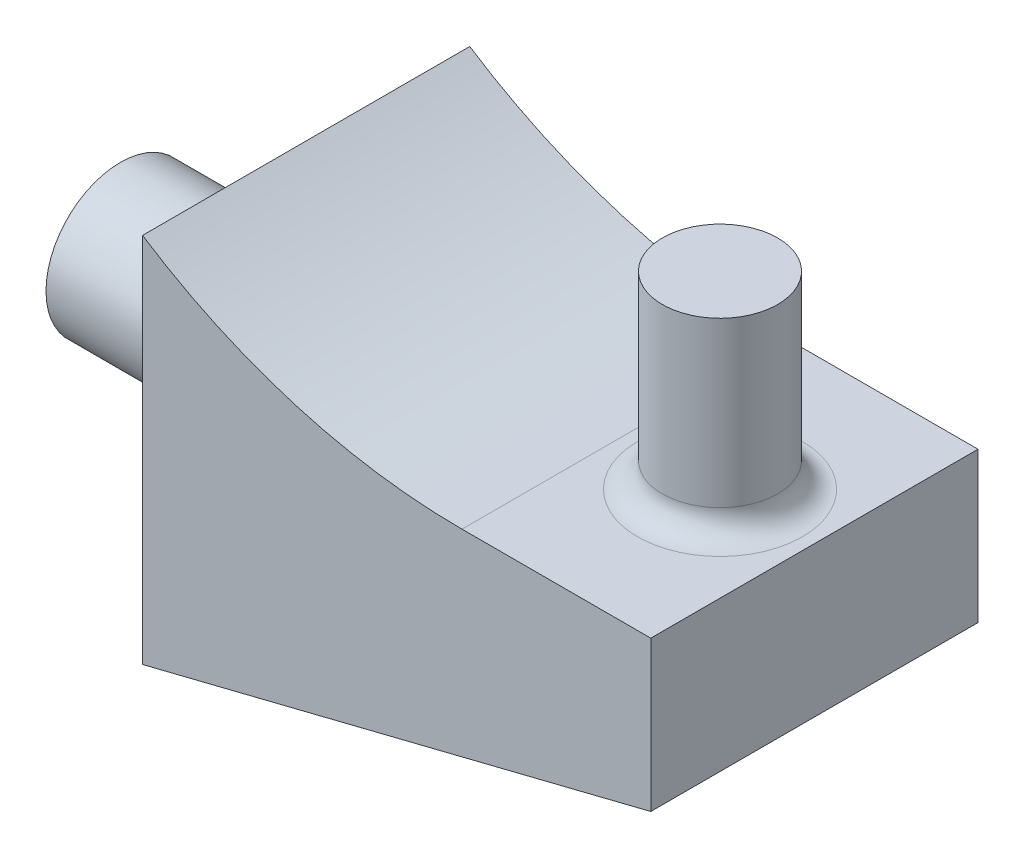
ISO-10303-21;
HEADER;
FILE_DESCRIPTION(('STEP AP214'),'2;1');
FILE_NAME('part.step','',(''),(''),'','','');
FILE_SCHEMA(('AUTOMOTIVE_DESIGN { 1 0 10303 214 1 1 1 1 }'));
ENDSEC;
DATA;
#1=APPLICATION_CONTEXT('core data for automotive mechanical design processes');
#2=APPLICATION_PROTOCOL_DEFINITION('international standard','automotive_design',2000,#1);
#3=PRODUCT_CONTEXT('',#1,'mechanical');
#4=PRODUCT('Part','Part','',(#3));
#5=PRODUCT_RELATED_PRODUCT_CATEGORY('part','',(#4));
#6=PRODUCT_DEFINITION_FORMATION('','',#4);
#7=PRODUCT_DEFINITION_CONTEXT('part definition',#1,'design');
#8=PRODUCT_DEFINITION('design','',#6,#7);
#9=PRODUCT_DEFINITION_SHAPE('','',#8);
#10=(LENGTH_UNIT() NAMED_UNIT(*) SI_UNIT(.MILLI.,.METRE.));
#11=(NAMED_UNIT(*) PLANE_ANGLE_UNIT() SI_UNIT($,.RADIAN.));
#12=(NAMED_UNIT(*) SI_UNIT($,.STERADIAN.) SOLID_ANGLE_UNIT());
#13=UNCERTAINTY_MEASURE_WITH_UNIT(LENGTH_MEASURE(1.E-05),#10,'distance_accuracy_value','');
#14=(GEOMETRIC_REPRESENTATION_CONTEXT(3) GLOBAL_UNCERTAINTY_ASSIGNED_CONTEXT((#13)) GLOBAL_UNIT_ASSIGNED_CONTEXT((#10,
#11,#12)) REPRESENTATION_CONTEXT('',''));
#15=CARTESIAN_POINT('',(0.,0.,0.));
#16=DIRECTION('',(0.,0.,1.));
#17=DIRECTION('',(1.,0.,0.));
#18=AXIS2_PLACEMENT_3D('',#15,#16,#17);
#19=CARTESIAN_POINT('',(279.196722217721,314.68729340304,26.416));
#20=DIRECTION('',(0.,0.,-1.));
#21=DIRECTION('',(-1.,0.,0.));
#22=AXIS2_PLACEMENT_3D('',#19,#20,#21);
#23=CYLINDRICAL_SURFACE('',#22,47.3438129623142);
#24=CARTESIAN_POINT('',(279.196722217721,314.68729340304,0.));
#25=DIRECTION('',(0.,0.,-1.));
#26=DIRECTION('',(-1.,0.,0.));
#27=AXIS2_PLACEMENT_3D('',#24,#25,#26);
#28=CIRCLE('',#27,47.3438129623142);
#29=CARTESIAN_POINT('',(279.196722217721,267.343480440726,0.));
#30=VERTEX_POINT('',#29);
#31=CARTESIAN_POINT('',(253.40533417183,274.985392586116,0.));
#32=VERTEX_POINT('',#31);
#33=EDGE_CURVE('E122',#30,#32,#28,.T.);
#34=ORIENTED_EDGE('',*,*,#33,.T.);
#35=DIRECTION('',(0.,0.,-1.));
#36=VECTOR('',#35,1.);
#37=CARTESIAN_POINT('',(253.40533417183,274.985392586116,26.416));
#38=LINE('',#37,#36);
#39=CARTESIAN_POINT('',(253.40533417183,274.985392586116,26.416));
#40=VERTEX_POINT('',#39);
#41=EDGE_CURVE('E135',#40,#32,#38,.T.);
#42=ORIENTED_EDGE('',*,*,#41,.F.);
#43=CARTESIAN_POINT('',(279.196722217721,314.68729340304,26.416));
#44=DIRECTION('',(0.,0.,-1.));
#45=DIRECTION('',(-1.,0.,0.));
#46=AXIS2_PLACEMENT_3D('',#43,#44,#45);
#47=CIRCLE('',#46,47.3438129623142);
#48=CARTESIAN_POINT('',(279.196722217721,267.343480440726,26.416));
#49=VERTEX_POINT('',#48);
#50=EDGE_CURVE('E131',#49,#40,#47,.T.);
#51=ORIENTED_EDGE('',*,*,#50,.F.);
#52=DIRECTION('',(0.,0.,-1.));
#53=VECTOR('',#52,1.);
#54=CARTESIAN_POINT('',(279.196722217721,267.343480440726,26.416));
#55=LINE('',#54,#53);
#56=EDGE_CURVE('E118',#49,#30,#55,.T.);
#57=ORIENTED_EDGE('',*,*,#56,.T.);
#58=EDGE_LOOP('',(#34,#42,#51,#57));
#59=FACE_BOUND('',#58,.T.);
#60=ADVANCED_FACE('F45',(#59),#23,.F.);
#61=CARTESIAN_POINT('',(253.40533417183,274.985392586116,26.416));
#62=DIRECTION('',(1.,0.,0.));
#63=DIRECTION('',(0.,0.,-1.));
#64=AXIS2_PLACEMENT_3D('',#61,#62,#63);
#65=PLANE('',#64);
#66=CARTESIAN_POINT('',(253.40533417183,259.985392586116,13.208));
#67=DIRECTION('',(1.,0.,0.));
#68=DIRECTION('',(0.,0.,-1.));
#69=AXIS2_PLACEMENT_3D('',#66,#67,#68);
#70=CIRCLE('',#69,8.);
#71=CARTESIAN_POINT('',(253.40533417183,259.985392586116,5.208));
#72=VERTEX_POINT('',#71);
#73=EDGE_CURVE('E140',#72,#72,#70,.T.);
#74=ORIENTED_EDGE('',*,*,#73,.T.);
#75=EDGE_LOOP('',(#74));
#76=FACE_BOUND('',#75,.T.);
#77=DIRECTION('',(0.,-1.,0.));
#78=VECTOR('',#77,1.);
#79=CARTESIAN_POINT('',(253.40533417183,274.985392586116,0.));
#80=LINE('',#79,#78);
#81=CARTESIAN_POINT('',(253.40533417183,244.985392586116,0.));
#82=VERTEX_POINT('',#81);
#83=EDGE_CURVE('E125',#32,#82,#80,.T.);
#84=ORIENTED_EDGE('',*,*,#83,.T.);
#85=DIRECTION('',(0.,0.,-1.));
#86=VECTOR('',#85,1.);
#87=CARTESIAN_POINT('',(253.40533417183,244.985392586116,26.416));
#88=LINE('',#87,#86);
#89=CARTESIAN_POINT('',(253.40533417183,244.985392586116,26.416));
#90=VERTEX_POINT('',#89);
#91=EDGE_CURVE('E113',#90,#82,#88,.T.);
#92=ORIENTED_EDGE('',*,*,#91,.F.);
#93=DIRECTION('',(0.,-1.,0.));
#94=VECTOR('',#93,1.);
#95=CARTESIAN_POINT('',(253.40533417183,274.985392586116,26.416));
#96=LINE('',#95,#94);
#97=EDGE_CURVE('E97',#40,#90,#96,.T.);
#98=ORIENTED_EDGE('',*,*,#97,.F.);
#99=ORIENTED_EDGE('',*,*,#41,.T.);
#100=EDGE_LOOP('',(#84,#92,#98,#99));
#101=FACE_BOUND('',#100,.T.);
#102=ADVANCED_FACE('F159',(#76,#101),#65,.F.);
#103=CARTESIAN_POINT('',(253.40533417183,244.985392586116,26.416));
#104=DIRECTION('',(-0.242055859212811,0.970262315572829,0.));
#105=DIRECTION('',(-0.970262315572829,-0.242055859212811,0.));
#106=AXIS2_PLACEMENT_3D('',#103,#104,#105);
#107=PLANE('',#106);
#108=DIRECTION('',(0.970262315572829,0.242055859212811,0.));
#109=VECTOR('',#108,1.);
#110=CARTESIAN_POINT('',(253.40533417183,244.985392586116,0.));
#111=LINE('',#110,#109);
#112=CARTESIAN_POINT('',(294.436722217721,255.221684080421,0.));
#113=VERTEX_POINT('',#112);
#114=EDGE_CURVE('E112',#82,#113,#111,.T.);
#115=ORIENTED_EDGE('',*,*,#114,.T.);
#116=DIRECTION('',(0.,0.,-1.));
#117=VECTOR('',#116,1.);
#118=CARTESIAN_POINT('',(294.436722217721,255.221684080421,26.416));
#119=LINE('',#118,#117);
#120=CARTESIAN_POINT('',(294.436722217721,255.221684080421,26.416));
#121=VERTEX_POINT('',#120);
#122=EDGE_CURVE('E109',#121,#113,#119,.T.);
#123=ORIENTED_EDGE('',*,*,#122,.F.);
#124=DIRECTION('',(0.970262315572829,0.242055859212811,0.));
#125=VECTOR('',#124,1.);
#126=CARTESIAN_POINT('',(253.40533417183,244.985392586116,26.416));
#127=LINE('',#126,#125);
#128=EDGE_CURVE('E101',#90,#121,#127,.T.);
#129=ORIENTED_EDGE('',*,*,#128,.F.);
#130=ORIENTED_EDGE('',*,*,#91,.T.);
#131=EDGE_LOOP('',(#115,#123,#129,#130));
#132=FACE_BOUND('',#131,.T.);
#133=ADVANCED_FACE('F110',(#132),#107,.F.);
#134=CARTESIAN_POINT('',(294.436722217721,255.221684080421,26.416));
#135=DIRECTION('',(-1.,0.,0.));
#136=DIRECTION('',(0.,0.,1.));
#137=AXIS2_PLACEMENT_3D('',#134,#135,#136);
#138=PLANE('',#137);
#139=DIRECTION('',(0.,1.,0.));
#140=VECTOR('',#139,1.);
#141=CARTESIAN_POINT('',(294.436722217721,255.221684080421,0.));
#142=LINE('',#141,#140);
#143=CARTESIAN_POINT('',(294.436722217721,267.343480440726,0.));
#144=VERTEX_POINT('',#143);
#145=EDGE_CURVE('E82',#113,#144,#142,.T.);
#146=ORIENTED_EDGE('',*,*,#145,.T.);
#147=DIRECTION('',(0.,0.,-1.));
#148=VECTOR('',#147,1.);
#149=CARTESIAN_POINT('',(294.436722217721,267.343480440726,26.416));
#150=LINE('',#149,#148);
#151=CARTESIAN_POINT('',(294.436722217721,267.343480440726,26.416));
#152=VERTEX_POINT('',#151);
#153=EDGE_CURVE('E114',#152,#144,#150,.T.);
#154=ORIENTED_EDGE('',*,*,#153,.F.);
#155=DIRECTION('',(0.,1.,0.));
#156=VECTOR('',#155,1.);
#157=CARTESIAN_POINT('',(294.436722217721,255.221684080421,26.416));
#158=LINE('',#157,#156);
#159=EDGE_CURVE('E105',#121,#152,#158,.T.);
#160=ORIENTED_EDGE('',*,*,#159,.F.);
#161=ORIENTED_EDGE('',*,*,#122,.T.);
#162=EDGE_LOOP('',(#146,#154,#160,#161));
#163=FACE_BOUND('',#162,.T.);
#164=ADVANCED_FACE('F116',(#163),#138,.F.);
#165=CARTESIAN_POINT('',(294.436722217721,267.343480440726,26.416));
#166=DIRECTION('',(0.,-1.,0.));
#167=DIRECTION('',(0.,0.,-1.));
#168=AXIS2_PLACEMENT_3D('',#165,#166,#167);
#169=PLANE('',#168);
#170=CARTESIAN_POINT('',(286.816722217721,267.343480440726,13.208));
#171=DIRECTION('',(0.,-1.,0.));
#172=DIRECTION('',(0.,0.,-1.));
#173=AXIS2_PLACEMENT_3D('',#170,#171,#172);
#174=CIRCLE('',#173,6.65656786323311);
#175=CARTESIAN_POINT('',(286.816722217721,267.343480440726,6.55143213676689));
#176=VERTEX_POINT('',#175);
#177=EDGE_CURVE('E11',#176,#176,#174,.T.);
#178=ORIENTED_EDGE('',*,*,#177,.T.);
#179=EDGE_LOOP('',(#178));
#180=FACE_BOUND('',#179,.T.);
#181=DIRECTION('',(-1.,0.,0.));
#182=VECTOR('',#181,1.);
#183=CARTESIAN_POINT('',(294.436722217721,267.343480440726,0.));
#184=LINE('',#183,#182);
#185=EDGE_CURVE('E88',#144,#30,#184,.T.);
#186=ORIENTED_EDGE('',*,*,#185,.T.);
#187=ORIENTED_EDGE('',*,*,#56,.F.);
#188=DIRECTION('',(-1.,0.,0.));
#189=VECTOR('',#188,1.);
#190=CARTESIAN_POINT('',(294.436722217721,267.343480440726,26.416));
#191=LINE('',#190,#189);
#192=EDGE_CURVE('E62',#152,#49,#191,.T.);
#193=ORIENTED_EDGE('',*,*,#192,.F.);
#194=ORIENTED_EDGE('',*,*,#153,.T.);
#195=EDGE_LOOP('',(#186,#187,#193,#194));
#196=FACE_BOUND('',#195,.T.);
#197=ADVANCED_FACE('F172',(#180,#196),#169,.F.);
#198=CARTESIAN_POINT('',(279.196722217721,314.68729340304,26.416));
#199=DIRECTION('',(0.,0.,-1.));
#200=DIRECTION('',(-1.,0.,0.));
#201=AXIS2_PLACEMENT_3D('',#198,#199,#200);
#202=PLANE('',#201);
#203=ORIENTED_EDGE('',*,*,#50,.T.);
#204=ORIENTED_EDGE('',*,*,#97,.T.);
#205=ORIENTED_EDGE('',*,*,#128,.T.);
#206=ORIENTED_EDGE('',*,*,#159,.T.);
#207=ORIENTED_EDGE('',*,*,#192,.T.);
#208=EDGE_LOOP('',(#203,#204,#205,#206,#207));
#209=FACE_BOUND('',#208,.T.);
#210=ADVANCED_FACE('F103',(#209),#202,.F.);
#211=CARTESIAN_POINT('',(279.196722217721,314.68729340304,0.));
#212=DIRECTION('',(0.,0.,-1.));
#213=DIRECTION('',(-1.,0.,0.));
#214=AXIS2_PLACEMENT_3D('',#211,#212,#213);
#215=PLANE('',#214);
#216=ORIENTED_EDGE('',*,*,#33,.F.);
#217=ORIENTED_EDGE('',*,*,#185,.F.);
#218=ORIENTED_EDGE('',*,*,#145,.F.);
#219=ORIENTED_EDGE('',*,*,#114,.F.);
#220=ORIENTED_EDGE('',*,*,#83,.F.);
#221=EDGE_LOOP('',(#216,#217,#218,#219,#220));
#222=FACE_BOUND('',#221,.T.);
#223=ADVANCED_FACE('F176',(#222),#215,.T.);
#224=CARTESIAN_POINT('',(286.816722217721,282.583480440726,13.208));
#225=DIRECTION('',(0.,-1.,0.));
#226=DIRECTION('',(0.,0.,-1.));
#227=AXIS2_PLACEMENT_3D('',#224,#225,#226);
#228=CYLINDRICAL_SURFACE('',#227,4.65656786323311);
#229=CARTESIAN_POINT('',(286.816722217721,269.343480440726,13.208));
#230=DIRECTION('',(0.,-1.,0.));
#231=DIRECTION('',(0.,0.,-1.));
#232=AXIS2_PLACEMENT_3D('',#229,#230,#231);
#233=CIRCLE('',#232,4.65656786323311);
#234=CARTESIAN_POINT('',(286.816722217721,269.343480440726,8.55143213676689));
#235=VERTEX_POINT('',#234);
#236=EDGE_CURVE('E54',#235,#235,#233,.F.);
#237=CARTESIAN_POINT('',(286.816722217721,282.583480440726,13.208));
#238=DIRECTION('',(0.,1.,0.));
#239=DIRECTION('',(0.,0.,1.));
#240=AXIS2_PLACEMENT_3D('',#237,#238,#239);
#241=CIRCLE('',#240,4.65656786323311);
#242=CARTESIAN_POINT('',(286.816722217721,282.583480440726,8.55143213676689));
#243=VERTEX_POINT('',#242);
#244=EDGE_CURVE('E126',#243,#243,#241,.T.);
#245=CARTESIAN_POINT('',(286.816722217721,269.343480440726,8.55143213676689));
#246=CARTESIAN_POINT('',(286.816722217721,269.481397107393,8.55143213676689));
#247=CARTESIAN_POINT('',(286.816722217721,269.619313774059,8.55143213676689));
#248=CARTESIAN_POINT('',(286.816722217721,269.895147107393,8.55143213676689));
#249=CARTESIAN_POINT('',(286.816722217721,270.033063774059,8.55143213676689));
#250=CARTESIAN_POINT('',(286.816722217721,270.308897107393,8.55143213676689));
#251=CARTESIAN_POINT('',(286.816722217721,270.446813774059,8.55143213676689));
#252=CARTESIAN_POINT('',(286.816722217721,270.722647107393,8.55143213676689));
#253=CARTESIAN_POINT('',(286.816722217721,270.860563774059,8.55143213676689));
#254=CARTESIAN_POINT('',(286.816722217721,271.136397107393,8.55143213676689));
#255=CARTESIAN_POINT('',(286.816722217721,271.274313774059,8.55143213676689));
#256=CARTESIAN_POINT('',(286.816722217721,271.550147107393,8.55143213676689));
#257=CARTESIAN_POINT('',(286.816722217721,271.688063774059,8.55143213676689));
#258=CARTESIAN_POINT('',(286.816722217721,271.963897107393,8.55143213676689));
#259=CARTESIAN_POINT('',(286.816722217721,272.101813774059,8.55143213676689));
#260=CARTESIAN_POINT('',(286.816722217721,272.377647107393,8.55143213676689));
#261=CARTESIAN_POINT('',(286.816722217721,272.515563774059,8.55143213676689));
#262=CARTESIAN_POINT('',(286.816722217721,272.791397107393,8.55143213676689));
#263=CARTESIAN_POINT('',(286.816722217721,272.929313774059,8.55143213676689));
#264=CARTESIAN_POINT('',(286.816722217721,273.205147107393,8.55143213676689));
#265=CARTESIAN_POINT('',(286.816722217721,273.343063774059,8.55143213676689));
#266=CARTESIAN_POINT('',(286.816722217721,273.618897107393,8.55143213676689));
#267=CARTESIAN_POINT('',(286.816722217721,273.756813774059,8.55143213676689));
#268=CARTESIAN_POINT('',(286.816722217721,274.032647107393,8.55143213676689));
#269=CARTESIAN_POINT('',(286.816722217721,274.170563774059,8.55143213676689));
#270=CARTESIAN_POINT('',(286.816722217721,274.446397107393,8.55143213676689));
#271=CARTESIAN_POINT('',(286.816722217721,274.584313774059,8.55143213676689));
#272=CARTESIAN_POINT('',(286.816722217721,274.860147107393,8.55143213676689));
#273=CARTESIAN_POINT('',(286.816722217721,274.998063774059,8.55143213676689));
#274=CARTESIAN_POINT('',(286.816722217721,275.273897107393,8.55143213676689));
#275=CARTESIAN_POINT('',(286.816722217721,275.411813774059,8.55143213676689));
#276=CARTESIAN_POINT('',(286.816722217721,275.687647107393,8.55143213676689));
#277=CARTESIAN_POINT('',(286.816722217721,275.825563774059,8.55143213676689));
#278=CARTESIAN_POINT('',(286.816722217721,276.101397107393,8.55143213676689));
#279=CARTESIAN_POINT('',(286.816722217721,276.239313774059,8.55143213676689));
#280=CARTESIAN_POINT('',(286.816722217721,276.515147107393,8.55143213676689));
#281=CARTESIAN_POINT('',(286.816722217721,276.653063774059,8.55143213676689));
#282=CARTESIAN_POINT('',(286.816722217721,276.928897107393,8.55143213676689));
#283=CARTESIAN_POINT('',(286.816722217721,277.066813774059,8.55143213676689));
#284=CARTESIAN_POINT('',(286.816722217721,277.342647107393,8.55143213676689));
#285=CARTESIAN_POINT('',(286.816722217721,277.480563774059,8.55143213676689));
#286=CARTESIAN_POINT('',(286.816722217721,277.756397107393,8.55143213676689));
#287=CARTESIAN_POINT('',(286.816722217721,277.894313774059,8.55143213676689));
#288=CARTESIAN_POINT('',(286.816722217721,278.170147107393,8.55143213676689));
#289=CARTESIAN_POINT('',(286.816722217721,278.308063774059,8.55143213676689));
#290=CARTESIAN_POINT('',(286.816722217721,278.583897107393,8.55143213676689));
#291=CARTESIAN_POINT('',(286.816722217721,278.721813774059,8.55143213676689));
#292=CARTESIAN_POINT('',(286.816722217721,278.997647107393,8.55143213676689));
#293=CARTESIAN_POINT('',(286.816722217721,279.135563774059,8.55143213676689));
#294=CARTESIAN_POINT('',(286.816722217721,279.411397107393,8.55143213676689));
#295=CARTESIAN_POINT('',(286.816722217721,279.549313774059,8.55143213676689));
#296=CARTESIAN_POINT('',(286.816722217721,279.825147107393,8.55143213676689));
#297=CARTESIAN_POINT('',(286.816722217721,279.963063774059,8.55143213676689));
#298=CARTESIAN_POINT('',(286.816722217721,280.238897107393,8.55143213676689));
#299=CARTESIAN_POINT('',(286.816722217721,280.376813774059,8.55143213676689));
#300=CARTESIAN_POINT('',(286.816722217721,280.652647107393,8.55143213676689));
#301=CARTESIAN_POINT('',(286.816722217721,280.790563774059,8.55143213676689));
#302=CARTESIAN_POINT('',(286.816722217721,281.066397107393,8.55143213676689));
#303=CARTESIAN_POINT('',(286.816722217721,281.204313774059,8.55143213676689));
#304=CARTESIAN_POINT('',(286.816722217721,281.480147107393,8.55143213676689));
#305=CARTESIAN_POINT('',(286.816722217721,281.618063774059,8.55143213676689));
#306=CARTESIAN_POINT('',(286.816722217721,281.893897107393,8.55143213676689));
#307=CARTESIAN_POINT('',(286.816722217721,282.031813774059,8.55143213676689));
#308=CARTESIAN_POINT('',(286.816722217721,282.307647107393,8.55143213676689));
#309=CARTESIAN_POINT('',(286.816722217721,282.445563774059,8.55143213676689));
#310=CARTESIAN_POINT('',(286.816722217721,282.583480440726,8.55143213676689));
#311=B_SPLINE_CURVE_WITH_KNOTS('',3,(#245,#246,#247,#248,#249,#250,#251,#252,#253,#254,#255,
#256,#257,#258,#259,#260,#261,#262,#263,#264,#265,#266,#267,#268,#269,#270,#271,#272,#273,#274,
#275,#276,#277,#278,#279,#280,#281,#282,#283,#284,#285,#286,#287,#288,#289,#290,#291,#292,#293,
#294,#295,#296,#297,#298,#299,#300,#301,#302,#303,#304,#305,#306,#307,#308,#309,#310),
.UNSPECIFIED.,.F.,.F.,(4,2,2,2,2,2,2,2,2,2,2,2,2,2,2,2,2,2,2,2,2,2,2,2,2,2,2,2,2,2,2,2,4),(0.,
0.413750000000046,0.827500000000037,1.24125000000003,1.65500000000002,2.06875000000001,2.4825,
2.89624999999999,3.30999999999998,3.72375000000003,4.13750000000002,4.55125000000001,4.965,
5.37874999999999,5.79249999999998,6.20624999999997,6.61999999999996,7.03375,7.4475,
7.86124999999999,8.27499999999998,8.68874999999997,9.10249999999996,9.51624999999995,
9.92999999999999,10.34375,10.7575,11.17125,11.585,11.9987499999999,12.4124999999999,
12.8262499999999,13.24),.UNSPECIFIED.);
#312=EDGE_CURVE('BSEAM145',#235,#243,#311,.T.);
#313=ORIENTED_EDGE('',*,*,#236,.T.);
#314=ORIENTED_EDGE('',*,*,#244,.F.);
#315=ORIENTED_EDGE('',*,*,#312,.T.);
#316=ORIENTED_EDGE('',*,*,#312,.F.);
#317=EDGE_LOOP('',(#313,#315,#314,#316));
#318=FACE_BOUND('',#317,.T.);
#319=ADVANCED_FACE('F145',(#318),#228,.T.);
#320=CARTESIAN_POINT('',(286.816722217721,282.583480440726,13.208));
#321=DIRECTION('',(0.,1.,0.));
#322=DIRECTION('',(0.,0.,1.));
#323=AXIS2_PLACEMENT_3D('',#320,#321,#322);
#324=PLANE('',#323);
#325=ORIENTED_EDGE('',*,*,#244,.T.);
#326=EDGE_LOOP('',(#325));
#327=FACE_BOUND('',#326,.T.);
#328=ADVANCED_FACE('F183',(#327),#324,.T.);
#329=CARTESIAN_POINT('',(238.40533417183,259.985392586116,13.208));
#330=DIRECTION('',(1.,0.,0.));
#331=DIRECTION('',(0.,0.,-1.));
#332=AXIS2_PLACEMENT_3D('',#329,#330,#331);
#333=CYLINDRICAL_SURFACE('',#332,6.);
#334=CARTESIAN_POINT('',(251.40533417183,259.985392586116,13.208));
#335=DIRECTION('',(1.,0.,0.));
#336=DIRECTION('',(0.,0.,-1.));
#337=AXIS2_PLACEMENT_3D('',#334,#335,#336);
#338=CIRCLE('',#337,6.);
#339=CARTESIAN_POINT('',(251.40533417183,259.985392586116,7.208));
#340=VERTEX_POINT('',#339);
#341=EDGE_CURVE('E137',#340,#340,#338,.F.);
#342=ORIENTED_EDGE('',*,*,#341,.T.);
#343=EDGE_LOOP('',(#342));
#344=FACE_BOUND('',#343,.T.);
#345=CARTESIAN_POINT('',(238.40533417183,259.985392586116,13.208));
#346=DIRECTION('',(-1.,0.,0.));
#347=DIRECTION('',(0.,0.,1.));
#348=AXIS2_PLACEMENT_3D('',#345,#346,#347);
#349=CIRCLE('',#348,6.);
#350=CARTESIAN_POINT('',(238.40533417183,259.985392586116,19.208));
#351=VERTEX_POINT('',#350);
#352=EDGE_CURVE('E197',#351,#351,#349,.T.);
#353=ORIENTED_EDGE('',*,*,#352,.F.);
#354=EDGE_LOOP('',(#353));
#355=FACE_BOUND('',#354,.T.);
#356=ADVANCED_FACE('F186',(#344,#355),#333,.T.);
#357=CARTESIAN_POINT('',(238.40533417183,259.985392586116,13.208));
#358=DIRECTION('',(-1.,0.,0.));
#359=DIRECTION('',(0.,0.,1.));
#360=AXIS2_PLACEMENT_3D('',#357,#358,#359);
#361=PLANE('',#360);
#362=ORIENTED_EDGE('',*,*,#352,.T.);
#363=EDGE_LOOP('',(#362));
#364=FACE_BOUND('',#363,.T.);
#365=ADVANCED_FACE('F155',(#364),#361,.T.);
#366=CARTESIAN_POINT('',(251.40533417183,259.985392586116,13.208));
#367=DIRECTION('',(1.,0.,0.));
#368=DIRECTION('',(0.,0.,-1.));
#369=AXIS2_PLACEMENT_3D('',#366,#367,#368);
#370=TOROIDAL_SURFACE('',#369,8.,2.);
#371=ORIENTED_EDGE('',*,*,#73,.F.);
#372=EDGE_LOOP('',(#371));
#373=FACE_BOUND('',#372,.T.);
#374=ORIENTED_EDGE('',*,*,#341,.F.);
#375=EDGE_LOOP('',(#374));
#376=FACE_BOUND('',#375,.T.);
#377=ADVANCED_FACE('F149',(#373,#376),#370,.F.);
#378=CARTESIAN_POINT('',(286.816722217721,269.343480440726,13.208));
#379=DIRECTION('',(0.,-1.,0.));
#380=DIRECTION('',(0.,0.,-1.));
#381=AXIS2_PLACEMENT_3D('',#378,#379,#380);
#382=TOROIDAL_SURFACE('',#381,6.65656786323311,2.);
#383=ORIENTED_EDGE('',*,*,#177,.F.);
#384=EDGE_LOOP('',(#383));
#385=FACE_BOUND('',#384,.T.);
#386=ORIENTED_EDGE('',*,*,#236,.F.);
#387=EDGE_LOOP('',(#386));
#388=FACE_BOUND('',#387,.T.);
#389=ADVANCED_FACE('F47',(#385,#388),#382,.F.);
#390=CLOSED_SHELL('',(#60,#102,#133,#164,#197,#210,#223,#319,#328,#356,#365,#377,#389));
#391=MANIFOLD_SOLID_BREP('B2',#390);
#392=ADVANCED_BREP_SHAPE_REPRESENTATION('',(#18,#391),#14);
#393=SHAPE_DEFINITION_REPRESENTATION(#9,#392);
ENDSEC;
END-ISO-10303-21;
